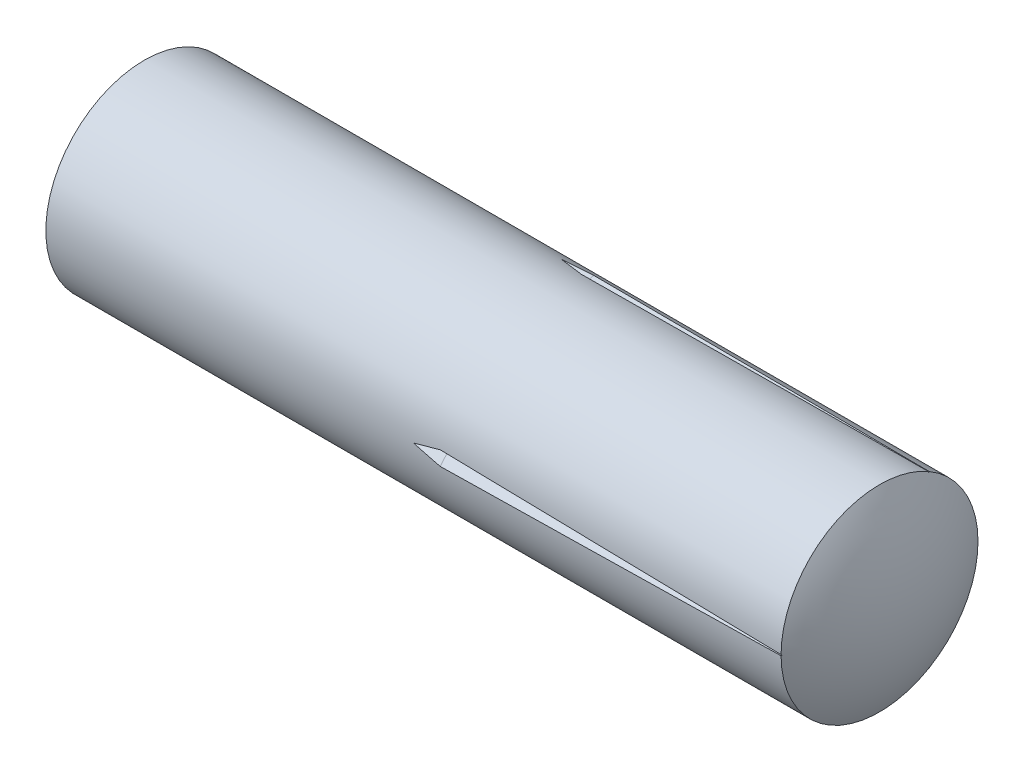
from build123d import *

# Parameters (mm, degrees)
CIRPATTERN1_COUNT = 3


with BuildPart() as part:
    # Sketch1 → Base-Revolve (revolve)
    with BuildSketch(Plane.XY):
        with BuildLine():
            Line((-50, 0), (-50, 1.25))
            ThreePointArc((-50, 1.25), (-49.010050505, 7.072345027), (-46.68190465, 12.5))
            Line((-46.68190465, 12.5), (46.650635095, 12.5))
            ThreePointArc((46.650635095, 12.5), (49.148145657, 6.470476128), (50, 0))
            Line((50, 0), (-50, 0))
        make_face()
    revolve(axis=Axis((-57, 0, 0), (1, 0, 0)))

    # Cut-Sweep1: sweep along a path in Sketch3
    with BuildLine(Plane(origin=(0, 0, 0), x_dir=(1, 0, 0), z_dir=(0, 1, 0))) as cut_sweep1_path:
        Line((0, -12.5), (3.125, -11.25))
        Line((3.125, -11.25), (50, -12.5))
    # Sketch2 → Cut-Sweep1 (sweep, cut)
    with BuildSketch(Plane(origin=(0, 0, 0), x_dir=(0, 0, -1), z_dir=(1, 0, 0))):
        Polygon((-12.5, 0), (-14.378358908, 1.315241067), (-14.378358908, -1.315241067), align=None)
    cut_sweep1 = sweep(path=cut_sweep1_path.line, transition=Transition.RIGHT, mode=Mode.SUBTRACT)

    # CirPattern1: Cut-Sweep1 ×3 about axis
    cirpattern1_axis = Axis((0, 0, 0), (1, 0, 0))
    for i in range(1, CIRPATTERN1_COUNT):
        add(cut_sweep1.rotate(cirpattern1_axis, i * 360 / CIRPATTERN1_COUNT), mode=Mode.SUBTRACT)


solid = part.part
